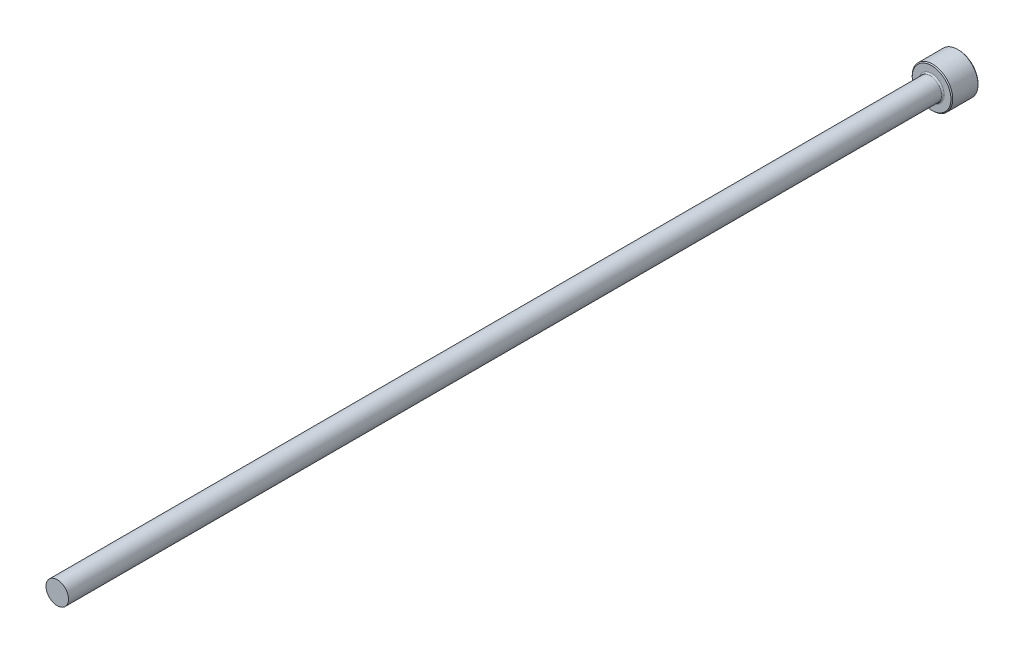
ISO-10303-21;
HEADER;
FILE_DESCRIPTION(('STEP AP214'),'2;1');
FILE_NAME('part.step','',(''),(''),'','','');
FILE_SCHEMA(('AUTOMOTIVE_DESIGN { 1 0 10303 214 1 1 1 1 }'));
ENDSEC;
DATA;
#1=APPLICATION_CONTEXT('core data for automotive mechanical design processes');
#2=APPLICATION_PROTOCOL_DEFINITION('international standard','automotive_design',2000,#1);
#3=PRODUCT_CONTEXT('',#1,'mechanical');
#4=PRODUCT('Part','Part','',(#3));
#5=PRODUCT_RELATED_PRODUCT_CATEGORY('part','',(#4));
#6=PRODUCT_DEFINITION_FORMATION('','',#4);
#7=PRODUCT_DEFINITION_CONTEXT('part definition',#1,'design');
#8=PRODUCT_DEFINITION('design','',#6,#7);
#9=PRODUCT_DEFINITION_SHAPE('','',#8);
#10=(LENGTH_UNIT() NAMED_UNIT(*) SI_UNIT(.MILLI.,.METRE.));
#11=(NAMED_UNIT(*) PLANE_ANGLE_UNIT() SI_UNIT($,.RADIAN.));
#12=(NAMED_UNIT(*) SI_UNIT($,.STERADIAN.) SOLID_ANGLE_UNIT());
#13=UNCERTAINTY_MEASURE_WITH_UNIT(LENGTH_MEASURE(1.E-05),#10,'distance_accuracy_value','');
#14=(GEOMETRIC_REPRESENTATION_CONTEXT(3) GLOBAL_UNCERTAINTY_ASSIGNED_CONTEXT((#13)) GLOBAL_UNIT_ASSIGNED_CONTEXT((#10,
#11,#12)) REPRESENTATION_CONTEXT('',''));
#15=CARTESIAN_POINT('',(0.,0.,0.));
#16=DIRECTION('',(0.,0.,1.));
#17=DIRECTION('',(1.,0.,0.));
#18=AXIS2_PLACEMENT_3D('',#15,#16,#17);
#19=CARTESIAN_POINT('',(0.,2.49999999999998,200.));
#20=DIRECTION('',(0.,0.,-1.));
#21=DIRECTION('',(-1.,0.,0.));
#22=AXIS2_PLACEMENT_3D('',#19,#20,#21);
#23=PLANE('',#22);
#24=CARTESIAN_POINT('',(0.,0.,200.));
#25=DIRECTION('',(0.,0.,1.));
#26=DIRECTION('',(1.,0.,0.));
#27=AXIS2_PLACEMENT_3D('',#24,#25,#26);
#28=CIRCLE('',#27,2.49999999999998);
#29=CARTESIAN_POINT('',(2.49999999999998,0.,200.));
#30=VERTEX_POINT('',#29);
#31=EDGE_CURVE('E50',#30,#30,#28,.T.);
#32=ORIENTED_EDGE('',*,*,#31,.T.);
#33=EDGE_LOOP('',(#32));
#34=FACE_BOUND('',#33,.T.);
#35=ADVANCED_FACE('F30',(#34),#23,.F.);
#36=CARTESIAN_POINT('',(0.,0.,109.050628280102));
#37=DIRECTION('',(0.,0.,1.));
#38=DIRECTION('',(1.,0.,0.));
#39=AXIS2_PLACEMENT_3D('',#36,#37,#38);
#40=CYLINDRICAL_SURFACE('',#39,2.49999999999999);
#41=ORIENTED_EDGE('',*,*,#31,.F.);
#42=EDGE_LOOP('',(#41));
#43=FACE_BOUND('',#42,.T.);
#44=CARTESIAN_POINT('',(0.,0.,6.3));
#45=DIRECTION('',(0.,0.,1.));
#46=DIRECTION('',(1.,0.,0.));
#47=AXIS2_PLACEMENT_3D('',#44,#45,#46);
#48=CIRCLE('',#47,2.5);
#49=CARTESIAN_POINT('',(2.5,0.,6.3));
#50=VERTEX_POINT('',#49);
#51=EDGE_CURVE('E53',#50,#50,#48,.T.);
#52=ORIENTED_EDGE('',*,*,#51,.T.);
#53=EDGE_LOOP('',(#52));
#54=FACE_BOUND('',#53,.T.);
#55=ADVANCED_FACE('F73',(#43,#54),#40,.T.);
#56=CARTESIAN_POINT('',(0.,0.,6.3));
#57=DIRECTION('',(0.,0.,1.));
#58=DIRECTION('',(1.,0.,0.));
#59=AXIS2_PLACEMENT_3D('',#56,#57,#58);
#60=TOROIDAL_SURFACE('',#59,2.8,0.3);
#61=ORIENTED_EDGE('',*,*,#51,.F.);
#62=EDGE_LOOP('',(#61));
#63=FACE_BOUND('',#62,.T.);
#64=CARTESIAN_POINT('',(0.,0.,6.00000000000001));
#65=DIRECTION('',(0.,0.,1.));
#66=DIRECTION('',(1.,0.,0.));
#67=AXIS2_PLACEMENT_3D('',#64,#65,#66);
#68=CIRCLE('',#67,2.8);
#69=CARTESIAN_POINT('',(2.8,0.,6.00000000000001));
#70=VERTEX_POINT('',#69);
#71=EDGE_CURVE('E56',#70,#70,#68,.T.);
#72=ORIENTED_EDGE('',*,*,#71,.T.);
#73=EDGE_LOOP('',(#72));
#74=FACE_BOUND('',#73,.T.);
#75=ADVANCED_FACE('F60',(#63,#74),#60,.F.);
#76=CARTESIAN_POINT('',(0.,4.5,6.));
#77=DIRECTION('',(0.,0.,-1.));
#78=DIRECTION('',(-1.,0.,0.));
#79=AXIS2_PLACEMENT_3D('',#76,#77,#78);
#80=PLANE('',#79);
#81=CARTESIAN_POINT('',(0.,0.,6.));
#82=DIRECTION('',(0.,0.,-1.));
#83=DIRECTION('',(-1.,0.,0.));
#84=AXIS2_PLACEMENT_3D('',#81,#82,#83);
#85=CIRCLE('',#84,4.3);
#86=CARTESIAN_POINT('',(-4.3,0.,6.));
#87=VERTEX_POINT('',#86);
#88=EDGE_CURVE('E10',#87,#87,#85,.F.);
#89=ORIENTED_EDGE('',*,*,#88,.T.);
#90=EDGE_LOOP('',(#89));
#91=FACE_BOUND('',#90,.T.);
#92=ORIENTED_EDGE('',*,*,#71,.F.);
#93=EDGE_LOOP('',(#92));
#94=FACE_BOUND('',#93,.T.);
#95=ADVANCED_FACE('F62',(#91,#94),#80,.F.);
#96=CARTESIAN_POINT('',(0.,0.,109.050628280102));
#97=DIRECTION('',(0.,0.,1.));
#98=DIRECTION('',(1.,0.,0.));
#99=AXIS2_PLACEMENT_3D('',#96,#97,#98);
#100=CYLINDRICAL_SURFACE('',#99,4.5);
#101=CARTESIAN_POINT('',(0.,0.,0.200000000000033));
#102=DIRECTION('',(0.,0.,1.));
#103=DIRECTION('',(1.,0.,0.));
#104=AXIS2_PLACEMENT_3D('',#101,#102,#103);
#105=CIRCLE('',#104,4.5);
#106=CARTESIAN_POINT('',(4.5,0.,0.200000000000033));
#107=VERTEX_POINT('',#106);
#108=EDGE_CURVE('E41',#107,#107,#105,.T.);
#109=ORIENTED_EDGE('',*,*,#108,.T.);
#110=EDGE_LOOP('',(#109));
#111=FACE_BOUND('',#110,.T.);
#112=CARTESIAN_POINT('',(0.,0.,5.8));
#113=DIRECTION('',(0.,0.,-1.));
#114=DIRECTION('',(-1.,0.,0.));
#115=AXIS2_PLACEMENT_3D('',#112,#113,#114);
#116=CIRCLE('',#115,4.5);
#117=CARTESIAN_POINT('',(-4.5,0.,5.8));
#118=VERTEX_POINT('',#117);
#119=EDGE_CURVE('E45',#118,#118,#116,.T.);
#120=ORIENTED_EDGE('',*,*,#119,.T.);
#121=EDGE_LOOP('',(#120));
#122=FACE_BOUND('',#121,.T.);
#123=ADVANCED_FACE('F64',(#111,#122),#100,.T.);
#124=CARTESIAN_POINT('',(0.,0.,0.));
#125=DIRECTION('',(0.,0.,1.));
#126=DIRECTION('',(1.,0.,0.));
#127=AXIS2_PLACEMENT_3D('',#124,#125,#126);
#128=PLANE('',#127);
#129=CARTESIAN_POINT('',(0.,0.,0.));
#130=DIRECTION('',(0.,0.,1.));
#131=DIRECTION('',(1.,0.,0.));
#132=AXIS2_PLACEMENT_3D('',#129,#130,#131);
#133=CIRCLE('',#132,4.29999999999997);
#134=CARTESIAN_POINT('',(4.29999999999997,0.,0.));
#135=VERTEX_POINT('',#134);
#136=EDGE_CURVE('E37',#135,#135,#133,.F.);
#137=ORIENTED_EDGE('',*,*,#136,.T.);
#138=EDGE_LOOP('',(#137));
#139=FACE_BOUND('',#138,.T.);
#140=ADVANCED_FACE('F70',(#139),#128,.F.);
#141=CARTESIAN_POINT('',(0.,0.,0.200000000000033));
#142=DIRECTION('',(0.,0.,1.));
#143=DIRECTION('',(1.,0.,0.));
#144=AXIS2_PLACEMENT_3D('',#141,#142,#143);
#145=CONICAL_SURFACE('',#144,4.5,0.785398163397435);
#146=ORIENTED_EDGE('',*,*,#136,.F.);
#147=EDGE_LOOP('',(#146));
#148=FACE_BOUND('',#147,.T.);
#149=ORIENTED_EDGE('',*,*,#108,.F.);
#150=EDGE_LOOP('',(#149));
#151=FACE_BOUND('',#150,.T.);
#152=ADVANCED_FACE('F84',(#148,#151),#145,.T.);
#153=CARTESIAN_POINT('',(0.,0.,6.00000000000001));
#154=DIRECTION('',(0.,0.,-1.));
#155=DIRECTION('',(-1.,0.,0.));
#156=AXIS2_PLACEMENT_3D('',#153,#154,#155);
#157=CONICAL_SURFACE('',#156,4.3,0.785398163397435);
#158=ORIENTED_EDGE('',*,*,#119,.F.);
#159=EDGE_LOOP('',(#158));
#160=FACE_BOUND('',#159,.T.);
#161=ORIENTED_EDGE('',*,*,#88,.F.);
#162=EDGE_LOOP('',(#161));
#163=FACE_BOUND('',#162,.T.);
#164=ADVANCED_FACE('F32',(#160,#163),#157,.T.);
#165=CLOSED_SHELL('',(#35,#55,#75,#95,#123,#140,#152,#164));
#166=MANIFOLD_SOLID_BREP('B2',#165);
#167=ADVANCED_BREP_SHAPE_REPRESENTATION('',(#18,#166),#14);
#168=SHAPE_DEFINITION_REPRESENTATION(#9,#167);
ENDSEC;
END-ISO-10303-21;
